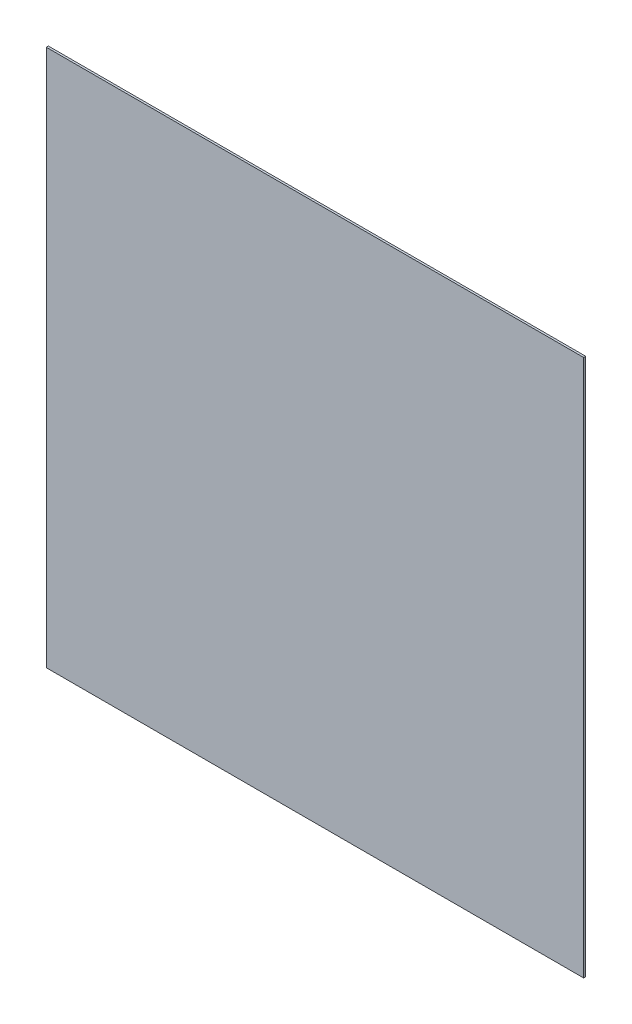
from build123d import *

# Parameters (mm, degrees)
SKETCH1_W      = 825.5
SKETCH1_H      = 825.5
EXTRUDE1_DEPTH = 1.5875


with BuildPart() as part:
    # Sketch1 → Extrude1 (new, symmetric)
    with BuildSketch(Plane.XY):
        Rectangle(SKETCH1_W, SKETCH1_H)
    extrude(amount=EXTRUDE1_DEPTH, both=True)


solid = part.part
